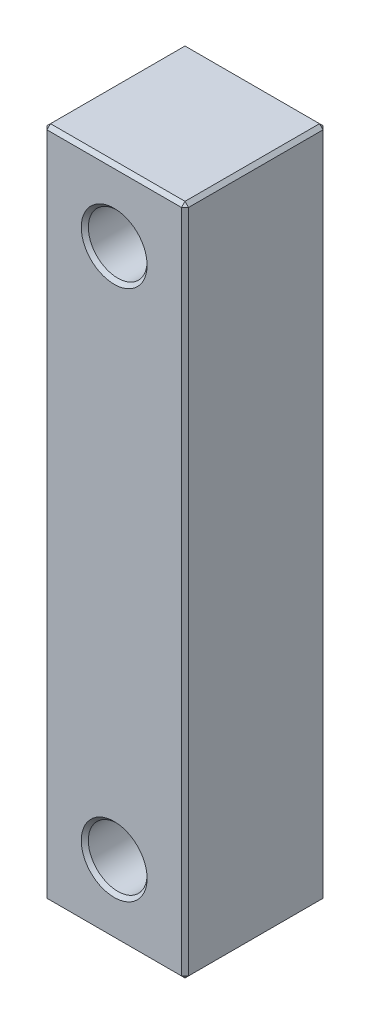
from build123d import *

# Parameters (mm, degrees)
ESQUISSE1_W          = 20
ESQUISSE1_H          = 95
ESQUISSE1_R          = 4.15
BASE_EXTRUSION_DEPTH = 20
CHANFREIN3_SIZE      = 0.5


with BuildPart() as part:
    # Esquisse1 → Base-Extrusion (new body)
    with BuildSketch(Plane.XY):
        with Locations((-37.5, 0)):
            Rectangle(ESQUISSE1_W, ESQUISSE1_H)
        with Locations(Location((-37.5, -37.5, 0), (0, 0, 180))):
            Circle(ESQUISSE1_R, mode=Mode.SUBTRACT)
        with Locations(Location((-37.5, 37.5, 0), (0, 0, 180))):
            Circle(ESQUISSE1_R, mode=Mode.SUBTRACT)
    extrude(amount=-BASE_EXTRUSION_DEPTH)

    # Chanfrein3
    chanfrein3_edges = [part.edges().sort_by_distance(p)[0] for p in [
        (-47.5, 47.5, -10),
        (-27.5, 47.5, -10),
        (-37.5, 47.5, 0),
        (-37.5, 47.5, -20),
        (-27.5, -47.5, -10),
        (-27.5, 0, 0),
        (-27.5, 0, -20),
        (-47.5, -47.5, -10),
        (-37.5, -47.5, 0),
        (-37.5, -47.5, -20),
        (-47.5, 0, 0),
        (-47.5, 0, -20),
        (-33.35, -37.5, 0),
        (-33.35, -37.5, -20),
        (-33.35, 37.5, 0),
        (-33.35, 37.5, -20),
    ]]
    chamfer(chanfrein3_edges, length=CHANFREIN3_SIZE)


solid = part.part
